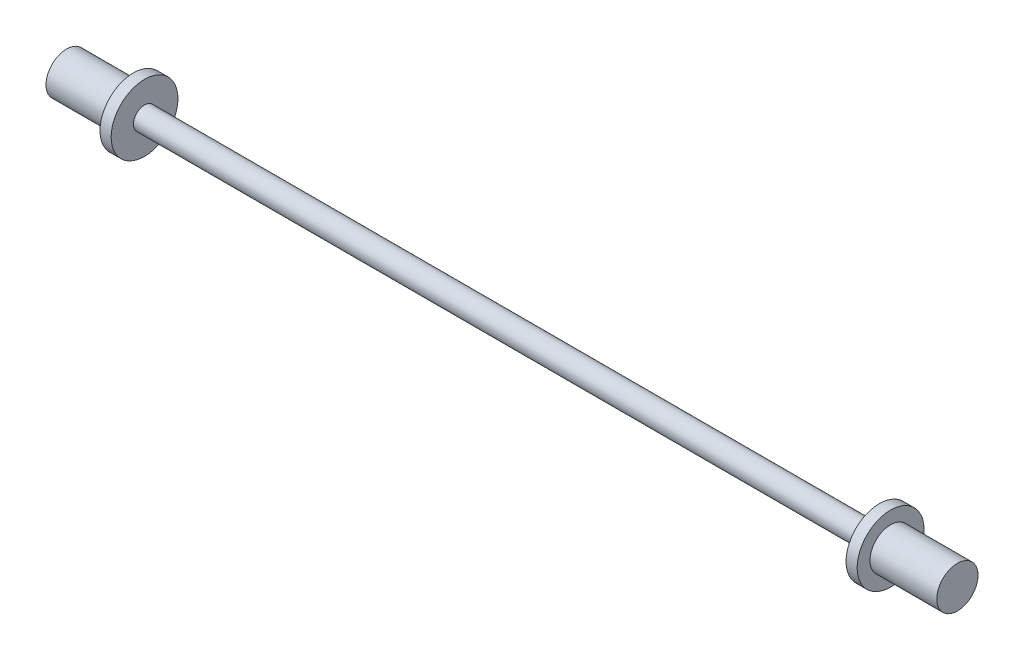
from build123d import *

# Parameters (mm, degrees)
BOSS_EXTRUDE1_DEPTH      = 247.65
BOSS_EXTRUDE1_DEPTH_BACK = 171.45
SKETCH2_R                = 6.35
SKETCH3_R                = 19.05
BOSS_EXTRUDE2_DEPTH      = 6.35
BOSS_EXTRUDE4_START      = 6.35
SKETCH7_R                = 19.05
BOSS_EXTRUDE4_DEPTH      = 6.35
SKETCH9_R                = 11.77
BOSS_EXTRUDE6_DEPTH      = 38.1
BOSS_EXTRUDE7_START      = 38.1
SKETCH10_R               = 11.77
BOSS_EXTRUDE7_DEPTH      = 38.1


with BuildPart() as part:
    # Sketch2 → Boss-Extrude1 (new, two sides: drawn at the far end of the back side and taken through both)
    with BuildSketch(Plane(origin=(0, 0, 0), x_dir=(0, 0, -1), z_dir=(1, 0, 0)).offset(-BOSS_EXTRUDE1_DEPTH_BACK)):
        Circle(SKETCH2_R)
    extrude(amount=BOSS_EXTRUDE1_DEPTH + BOSS_EXTRUDE1_DEPTH_BACK)

    # Sketch3 → Boss-Extrude2 (add)
    with BuildSketch(Plane(origin=(247.65, 0, 0), x_dir=(0, 0, -1), z_dir=(1, 0, 0))):
        Circle(SKETCH3_R)
    extrude(amount=BOSS_EXTRUDE2_DEPTH)

    # Sketch7 → Boss-Extrude4 (add)
    with BuildSketch(Plane.ZY.offset(171.45).offset(BOSS_EXTRUDE4_START)):
        with Locations(Location((0, 0, 0), (0, 0, 180))):
            Circle(SKETCH7_R)
    extrude(amount=-BOSS_EXTRUDE4_DEPTH)

    # Sketch9 → Boss-Extrude6 (add)
    with BuildSketch(Plane.ZY.offset(177.8)):
        with Locations(Location((0, 0, 0), (0, 0, 180))):
            Circle(SKETCH9_R)
    extrude(amount=BOSS_EXTRUDE6_DEPTH)

    # Sketch10 → Boss-Extrude7 (add)
    with BuildSketch(Plane(origin=(254, 0, 0), x_dir=(0, 0, -1), z_dir=(1, 0, 0)).offset(BOSS_EXTRUDE7_START)):
        Circle(SKETCH10_R)
    extrude(amount=-BOSS_EXTRUDE7_DEPTH)


solid = part.part
